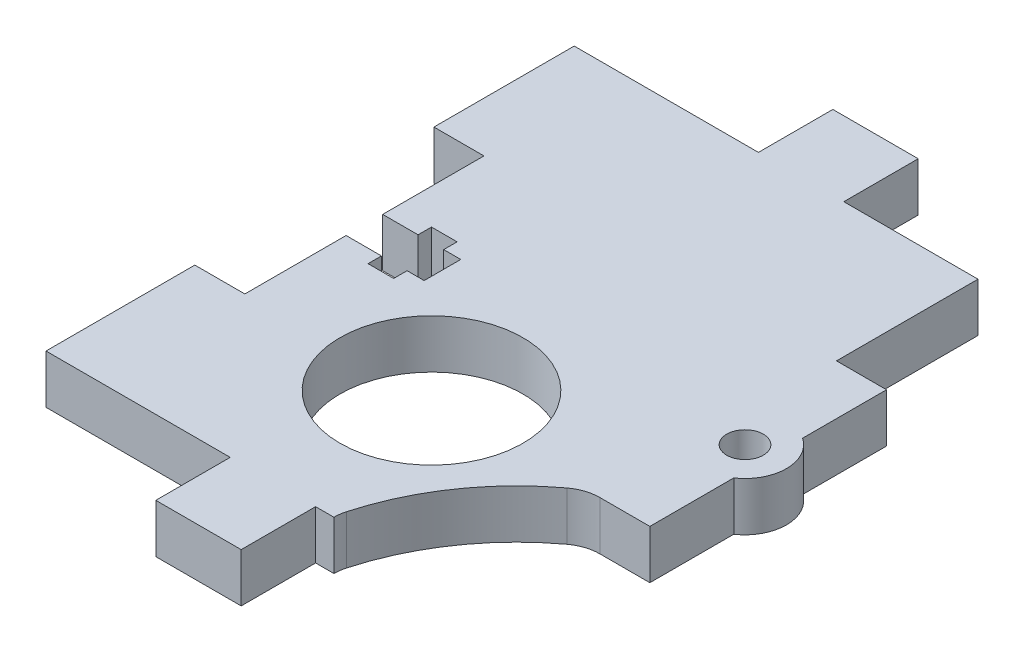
ISO-10303-21;
HEADER;
FILE_DESCRIPTION(('STEP AP214'),'2;1');
FILE_NAME('part.step','',(''),(''),'','','');
FILE_SCHEMA(('AUTOMOTIVE_DESIGN { 1 0 10303 214 1 1 1 1 }'));
ENDSEC;
DATA;
#1=APPLICATION_CONTEXT('core data for automotive mechanical design processes');
#2=APPLICATION_PROTOCOL_DEFINITION('international standard','automotive_design',2000,#1);
#3=PRODUCT_CONTEXT('',#1,'mechanical');
#4=PRODUCT('Part','Part','',(#3));
#5=PRODUCT_RELATED_PRODUCT_CATEGORY('part','',(#4));
#6=PRODUCT_DEFINITION_FORMATION('','',#4);
#7=PRODUCT_DEFINITION_CONTEXT('part definition',#1,'design');
#8=PRODUCT_DEFINITION('design','',#6,#7);
#9=PRODUCT_DEFINITION_SHAPE('','',#8);
#10=(LENGTH_UNIT() NAMED_UNIT(*) SI_UNIT(.MILLI.,.METRE.));
#11=(NAMED_UNIT(*) PLANE_ANGLE_UNIT() SI_UNIT($,.RADIAN.));
#12=(NAMED_UNIT(*) SI_UNIT($,.STERADIAN.) SOLID_ANGLE_UNIT());
#13=UNCERTAINTY_MEASURE_WITH_UNIT(LENGTH_MEASURE(1.E-05),#10,'distance_accuracy_value','');
#14=(GEOMETRIC_REPRESENTATION_CONTEXT(3) GLOBAL_UNCERTAINTY_ASSIGNED_CONTEXT((#13)) GLOBAL_UNIT_ASSIGNED_CONTEXT((#10,
#11,#12)) REPRESENTATION_CONTEXT('',''));
#15=CARTESIAN_POINT('',(0.,0.,0.));
#16=DIRECTION('',(0.,0.,1.));
#17=DIRECTION('',(1.,0.,0.));
#18=AXIS2_PLACEMENT_3D('',#15,#16,#17);
#19=CARTESIAN_POINT('',(-9.5,-2.,-2.6));
#20=DIRECTION('',(-1.,0.,0.));
#21=DIRECTION('',(0.,0.,1.));
#22=AXIS2_PLACEMENT_3D('',#19,#20,#21);
#23=PLANE('',#22);
#24=DIRECTION('',(0.,1.,0.));
#25=VECTOR('',#24,1.);
#26=CARTESIAN_POINT('',(-9.5,-2.,-2.6));
#27=LINE('',#26,#25);
#28=CARTESIAN_POINT('',(-9.5,-2.,-2.6));
#29=VERTEX_POINT('',#28);
#30=CARTESIAN_POINT('',(-9.5,2.,-2.6));
#31=VERTEX_POINT('',#30);
#32=EDGE_CURVE('E708',#29,#31,#27,.T.);
#33=ORIENTED_EDGE('',*,*,#32,.F.);
#34=DIRECTION('',(0.,0.,1.));
#35=VECTOR('',#34,1.);
#36=CARTESIAN_POINT('',(-9.5,-2.,-2.6));
#37=LINE('',#36,#35);
#38=CARTESIAN_POINT('',(-9.5,-2.,-1.5));
#39=VERTEX_POINT('',#38);
#40=EDGE_CURVE('E474',#29,#39,#37,.T.);
#41=ORIENTED_EDGE('',*,*,#40,.T.);
#42=DIRECTION('',(0.,1.,0.));
#43=VECTOR('',#42,1.);
#44=CARTESIAN_POINT('',(-9.5,-2.,-1.5));
#45=LINE('',#44,#43);
#46=CARTESIAN_POINT('',(-9.5,2.,-1.5));
#47=VERTEX_POINT('',#46);
#48=EDGE_CURVE('E464',#47,#39,#45,.F.);
#49=ORIENTED_EDGE('',*,*,#48,.F.);
#50=DIRECTION('',(0.,0.,1.));
#51=VECTOR('',#50,1.);
#52=CARTESIAN_POINT('',(-9.5,2.,0.));
#53=LINE('',#52,#51);
#54=EDGE_CURVE('E412',#31,#47,#53,.T.);
#55=ORIENTED_EDGE('',*,*,#54,.F.);
#56=EDGE_LOOP('',(#33,#41,#49,#55));
#57=FACE_BOUND('',#56,.T.);
#58=ADVANCED_FACE('F17',(#57),#23,.T.);
#59=CARTESIAN_POINT('',(-11.6,-2.,-1.5));
#60=DIRECTION('',(1.,0.,0.));
#61=DIRECTION('',(0.,0.,-1.));
#62=AXIS2_PLACEMENT_3D('',#59,#60,#61);
#63=PLANE('',#62);
#64=DIRECTION('',(0.,1.,0.));
#65=VECTOR('',#64,1.);
#66=CARTESIAN_POINT('',(-11.6,-2.,-1.5));
#67=LINE('',#66,#65);
#68=CARTESIAN_POINT('',(-11.6,-2.,-1.5));
#69=VERTEX_POINT('',#68);
#70=CARTESIAN_POINT('',(-11.6,2.,-1.5));
#71=VERTEX_POINT('',#70);
#72=EDGE_CURVE('E717',#69,#71,#67,.T.);
#73=ORIENTED_EDGE('',*,*,#72,.F.);
#74=DIRECTION('',(0.,0.,-1.));
#75=VECTOR('',#74,1.);
#76=CARTESIAN_POINT('',(-11.6,-2.,-1.5));
#77=LINE('',#76,#75);
#78=CARTESIAN_POINT('',(-11.6,-2.,-2.6));
#79=VERTEX_POINT('',#78);
#80=EDGE_CURVE('E471',#69,#79,#77,.T.);
#81=ORIENTED_EDGE('',*,*,#80,.T.);
#82=DIRECTION('',(0.,1.,0.));
#83=VECTOR('',#82,1.);
#84=CARTESIAN_POINT('',(-11.6,-2.,-2.6));
#85=LINE('',#84,#83);
#86=CARTESIAN_POINT('',(-11.6,2.,-2.6));
#87=VERTEX_POINT('',#86);
#88=EDGE_CURVE('E700',#87,#79,#85,.F.);
#89=ORIENTED_EDGE('',*,*,#88,.F.);
#90=DIRECTION('',(0.,0.,1.));
#91=VECTOR('',#90,1.);
#92=CARTESIAN_POINT('',(-11.6,2.,0.));
#93=LINE('',#92,#91);
#94=EDGE_CURVE('E415',#71,#87,#93,.F.);
#95=ORIENTED_EDGE('',*,*,#94,.F.);
#96=EDGE_LOOP('',(#73,#81,#89,#95));
#97=FACE_BOUND('',#96,.T.);
#98=ADVANCED_FACE('F757',(#97),#63,.T.);
#99=CARTESIAN_POINT('',(-8.1,-2.,1.5));
#100=DIRECTION('',(0.,0.,-1.));
#101=DIRECTION('',(-1.,0.,0.));
#102=AXIS2_PLACEMENT_3D('',#99,#100,#101);
#103=PLANE('',#102);
#104=DIRECTION('',(0.,1.,0.));
#105=VECTOR('',#104,1.);
#106=CARTESIAN_POINT('',(-8.1,-2.,1.5));
#107=LINE('',#106,#105);
#108=CARTESIAN_POINT('',(-8.1,-2.,1.5));
#109=VERTEX_POINT('',#108);
#110=CARTESIAN_POINT('',(-8.1,2.,1.5));
#111=VERTEX_POINT('',#110);
#112=EDGE_CURVE('E697',#109,#111,#107,.T.);
#113=ORIENTED_EDGE('',*,*,#112,.F.);
#114=DIRECTION('',(-1.,0.,0.));
#115=VECTOR('',#114,1.);
#116=CARTESIAN_POINT('',(-8.1,-2.,1.5));
#117=LINE('',#116,#115);
#118=CARTESIAN_POINT('',(-9.5,-2.,1.5));
#119=VERTEX_POINT('',#118);
#120=EDGE_CURVE('E468',#109,#119,#117,.T.);
#121=ORIENTED_EDGE('',*,*,#120,.T.);
#122=DIRECTION('',(0.,1.,0.));
#123=VECTOR('',#122,1.);
#124=CARTESIAN_POINT('',(-9.5,-2.,1.5));
#125=LINE('',#124,#123);
#126=CARTESIAN_POINT('',(-9.5,2.,1.5));
#127=VERTEX_POINT('',#126);
#128=EDGE_CURVE('E457',#127,#119,#125,.F.);
#129=ORIENTED_EDGE('',*,*,#128,.F.);
#130=DIRECTION('',(1.,0.,0.));
#131=VECTOR('',#130,1.);
#132=CARTESIAN_POINT('',(0.,2.,1.5));
#133=LINE('',#132,#131);
#134=EDGE_CURVE('E406',#111,#127,#133,.F.);
#135=ORIENTED_EDGE('',*,*,#134,.F.);
#136=EDGE_LOOP('',(#113,#121,#129,#135));
#137=FACE_BOUND('',#136,.T.);
#138=ADVANCED_FACE('F778',(#137),#103,.T.);
#139=CARTESIAN_POINT('',(-9.5,-2.,-1.5));
#140=DIRECTION('',(0.,0.,1.));
#141=DIRECTION('',(1.,0.,0.));
#142=AXIS2_PLACEMENT_3D('',#139,#140,#141);
#143=PLANE('',#142);
#144=ORIENTED_EDGE('',*,*,#48,.T.);
#145=DIRECTION('',(1.,0.,0.));
#146=VECTOR('',#145,1.);
#147=CARTESIAN_POINT('',(-9.5,-2.,-1.5));
#148=LINE('',#147,#146);
#149=CARTESIAN_POINT('',(-8.1,-2.,-1.5));
#150=VERTEX_POINT('',#149);
#151=EDGE_CURVE('E461',#39,#150,#148,.T.);
#152=ORIENTED_EDGE('',*,*,#151,.T.);
#153=DIRECTION('',(0.,1.,0.));
#154=VECTOR('',#153,1.);
#155=CARTESIAN_POINT('',(-8.1,-2.,-1.5));
#156=LINE('',#155,#154);
#157=CARTESIAN_POINT('',(-8.1,2.,-1.5));
#158=VERTEX_POINT('',#157);
#159=EDGE_CURVE('E689',#158,#150,#156,.F.);
#160=ORIENTED_EDGE('',*,*,#159,.F.);
#161=DIRECTION('',(1.,0.,0.));
#162=VECTOR('',#161,1.);
#163=CARTESIAN_POINT('',(0.,2.,-1.5));
#164=LINE('',#163,#162);
#165=EDGE_CURVE('E409',#47,#158,#164,.T.);
#166=ORIENTED_EDGE('',*,*,#165,.F.);
#167=EDGE_LOOP('',(#144,#152,#160,#166));
#168=FACE_BOUND('',#167,.T.);
#169=ADVANCED_FACE('F775',(#168),#143,.T.);
#170=CARTESIAN_POINT('',(-9.5,-2.,1.5));
#171=DIRECTION('',(-1.,0.,0.));
#172=DIRECTION('',(0.,0.,1.));
#173=AXIS2_PLACEMENT_3D('',#170,#171,#172);
#174=PLANE('',#173);
#175=ORIENTED_EDGE('',*,*,#128,.T.);
#176=DIRECTION('',(0.,0.,1.));
#177=VECTOR('',#176,1.);
#178=CARTESIAN_POINT('',(-9.5,-2.,1.5));
#179=LINE('',#178,#177);
#180=CARTESIAN_POINT('',(-9.5,-2.,2.6));
#181=VERTEX_POINT('',#180);
#182=EDGE_CURVE('E454',#119,#181,#179,.T.);
#183=ORIENTED_EDGE('',*,*,#182,.T.);
#184=DIRECTION('',(0.,1.,0.));
#185=VECTOR('',#184,1.);
#186=CARTESIAN_POINT('',(-9.5,-2.,2.6));
#187=LINE('',#186,#185);
#188=CARTESIAN_POINT('',(-9.5,2.,2.6));
#189=VERTEX_POINT('',#188);
#190=EDGE_CURVE('E678',#189,#181,#187,.F.);
#191=ORIENTED_EDGE('',*,*,#190,.F.);
#192=DIRECTION('',(0.,0.,1.));
#193=VECTOR('',#192,1.);
#194=CARTESIAN_POINT('',(-9.5,2.,0.));
#195=LINE('',#194,#193);
#196=EDGE_CURVE('E398',#127,#189,#195,.T.);
#197=ORIENTED_EDGE('',*,*,#196,.F.);
#198=EDGE_LOOP('',(#175,#183,#191,#197));
#199=FACE_BOUND('',#198,.T.);
#200=ADVANCED_FACE('F777',(#199),#174,.T.);
#201=CARTESIAN_POINT('',(-11.6,-2.,2.6));
#202=DIRECTION('',(1.,0.,0.));
#203=DIRECTION('',(0.,0.,-1.));
#204=AXIS2_PLACEMENT_3D('',#201,#202,#203);
#205=PLANE('',#204);
#206=DIRECTION('',(0.,1.,0.));
#207=VECTOR('',#206,1.);
#208=CARTESIAN_POINT('',(-11.6,-2.,2.6));
#209=LINE('',#208,#207);
#210=CARTESIAN_POINT('',(-11.6,-2.,2.6));
#211=VERTEX_POINT('',#210);
#212=CARTESIAN_POINT('',(-11.6,2.,2.6));
#213=VERTEX_POINT('',#212);
#214=EDGE_CURVE('E686',#211,#213,#209,.T.);
#215=ORIENTED_EDGE('',*,*,#214,.F.);
#216=DIRECTION('',(0.,0.,-1.));
#217=VECTOR('',#216,1.);
#218=CARTESIAN_POINT('',(-11.6,-2.,2.6));
#219=LINE('',#218,#217);
#220=CARTESIAN_POINT('',(-11.6,-2.,1.5));
#221=VERTEX_POINT('',#220);
#222=EDGE_CURVE('E451',#211,#221,#219,.T.);
#223=ORIENTED_EDGE('',*,*,#222,.T.);
#224=DIRECTION('',(0.,1.,0.));
#225=VECTOR('',#224,1.);
#226=CARTESIAN_POINT('',(-11.6,-2.,1.5));
#227=LINE('',#226,#225);
#228=CARTESIAN_POINT('',(-11.6,2.,1.5));
#229=VERTEX_POINT('',#228);
#230=EDGE_CURVE('E670',#229,#221,#227,.F.);
#231=ORIENTED_EDGE('',*,*,#230,.F.);
#232=DIRECTION('',(0.,0.,1.));
#233=VECTOR('',#232,1.);
#234=CARTESIAN_POINT('',(-11.6,2.,0.));
#235=LINE('',#234,#233);
#236=EDGE_CURVE('E392',#213,#229,#235,.F.);
#237=ORIENTED_EDGE('',*,*,#236,.F.);
#238=EDGE_LOOP('',(#215,#223,#231,#237));
#239=FACE_BOUND('',#238,.T.);
#240=ADVANCED_FACE('F785',(#239),#205,.T.);
#241=CARTESIAN_POINT('',(3.5,-2.,22.));
#242=DIRECTION('',(0.,0.,1.));
#243=DIRECTION('',(1.,0.,0.));
#244=AXIS2_PLACEMENT_3D('',#241,#242,#243);
#245=PLANE('',#244);
#246=DIRECTION('',(0.,1.,0.));
#247=VECTOR('',#246,1.);
#248=CARTESIAN_POINT('',(3.5,-2.,22.));
#249=LINE('',#248,#247);
#250=CARTESIAN_POINT('',(3.5,-2.,22.));
#251=VERTEX_POINT('',#250);
#252=CARTESIAN_POINT('',(3.5,2.,22.));
#253=VERTEX_POINT('',#252);
#254=EDGE_CURVE('E478',#251,#253,#249,.T.);
#255=ORIENTED_EDGE('',*,*,#254,.F.);
#256=DIRECTION('',(1.,0.,0.));
#257=VECTOR('',#256,1.);
#258=CARTESIAN_POINT('',(3.5,-2.,22.));
#259=LINE('',#258,#257);
#260=CARTESIAN_POINT('',(5.,-2.,22.));
#261=VERTEX_POINT('',#260);
#262=EDGE_CURVE('E330',#251,#261,#259,.T.);
#263=ORIENTED_EDGE('',*,*,#262,.T.);
#264=DIRECTION('',(0.,1.,0.));
#265=VECTOR('',#264,1.);
#266=CARTESIAN_POINT('',(5.,-2.,22.));
#267=LINE('',#266,#265);
#268=CARTESIAN_POINT('',(5.,2.,22.));
#269=VERTEX_POINT('',#268);
#270=EDGE_CURVE('E326',#261,#269,#267,.T.);
#271=ORIENTED_EDGE('',*,*,#270,.T.);
#272=DIRECTION('',(1.,0.,0.));
#273=VECTOR('',#272,1.);
#274=CARTESIAN_POINT('',(0.,2.,22.));
#275=LINE('',#274,#273);
#276=EDGE_CURVE('E385',#253,#269,#275,.T.);
#277=ORIENTED_EDGE('',*,*,#276,.F.);
#278=EDGE_LOOP('',(#255,#263,#271,#277));
#279=FACE_BOUND('',#278,.T.);
#280=ADVANCED_FACE('F906',(#279),#245,.T.);
#281=CARTESIAN_POINT('',(8.4,-2.,22.));
#282=DIRECTION('',(0.,1.,0.));
#283=DIRECTION('',(0.,0.,1.));
#284=AXIS2_PLACEMENT_3D('',#281,#282,#283);
#285=CYLINDRICAL_SURFACE('',#284,3.4);
#286=CARTESIAN_POINT('',(8.4,2.,22.));
#287=DIRECTION('',(0.,1.,0.));
#288=DIRECTION('',(0.,0.,1.));
#289=AXIS2_PLACEMENT_3D('',#286,#287,#288);
#290=CIRCLE('',#289,3.4);
#291=CARTESIAN_POINT('',(5.12304267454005,2.,21.093605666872));
#292=VERTEX_POINT('',#291);
#293=EDGE_CURVE('E382',#269,#292,#290,.F.);
#294=ORIENTED_EDGE('',*,*,#293,.F.);
#295=ORIENTED_EDGE('',*,*,#270,.F.);
#296=CARTESIAN_POINT('',(8.4,-2.,22.));
#297=DIRECTION('',(0.,1.,0.));
#298=DIRECTION('',(0.,0.,1.));
#299=AXIS2_PLACEMENT_3D('',#296,#297,#298);
#300=CIRCLE('',#299,3.4);
#301=CARTESIAN_POINT('',(5.12304267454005,-2.,21.093605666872));
#302=VERTEX_POINT('',#301);
#303=EDGE_CURVE('E20',#302,#261,#300,.T.);
#304=ORIENTED_EDGE('',*,*,#303,.F.);
#305=DIRECTION('',(0.,1.,0.));
#306=VECTOR('',#305,1.);
#307=CARTESIAN_POINT('',(5.12304267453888,-2.,21.0936056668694));
#308=LINE('',#307,#306);
#309=EDGE_CURVE('E324',#302,#292,#308,.T.);
#310=ORIENTED_EDGE('',*,*,#309,.T.);
#311=EDGE_LOOP('',(#294,#295,#304,#310));
#312=FACE_BOUND('',#311,.T.);
#313=ADVANCED_FACE('F323',(#312),#285,.F.);
#314=CARTESIAN_POINT('',(0.,2.,0.));
#315=DIRECTION('',(0.,1.,0.));
#316=DIRECTION('',(0.,0.,1.));
#317=AXIS2_PLACEMENT_3D('',#314,#315,#316);
#318=PLANE('',#317);
#319=CARTESIAN_POINT('',(0.,2.,9.));
#320=DIRECTION('',(0.,1.,0.));
#321=DIRECTION('',(0.,0.,1.));
#322=AXIS2_PLACEMENT_3D('',#319,#320,#321);
#323=CIRCLE('',#322,7.5);
#324=CARTESIAN_POINT('',(0.,2.,16.5));
#325=VERTEX_POINT('',#324);
#326=EDGE_CURVE('E361',#325,#325,#323,.F.);
#327=ORIENTED_EDGE('',*,*,#326,.T.);
#328=EDGE_LOOP('',(#327));
#329=FACE_BOUND('',#328,.T.);
#330=CARTESIAN_POINT('',(16.7,2.,0.));
#331=DIRECTION('',(0.,1.,0.));
#332=DIRECTION('',(0.,0.,1.));
#333=AXIS2_PLACEMENT_3D('',#330,#331,#332);
#334=CIRCLE('',#333,1.5);
#335=CARTESIAN_POINT('',(16.7,2.,1.5));
#336=VERTEX_POINT('',#335);
#337=EDGE_CURVE('E366',#336,#336,#334,.F.);
#338=ORIENTED_EDGE('',*,*,#337,.T.);
#339=EDGE_LOOP('',(#338));
#340=FACE_BOUND('',#339,.T.);
#341=DIRECTION('',(-1.,0.,0.));
#342=VECTOR('',#341,1.);
#343=CARTESIAN_POINT('',(-3.5,2.,-21.3));
#344=LINE('',#343,#342);
#345=CARTESIAN_POINT('',(-18.6,2.,-21.3));
#346=VERTEX_POINT('',#345);
#347=CARTESIAN_POINT('',(-3.5,2.,-21.3));
#348=VERTEX_POINT('',#347);
#349=EDGE_CURVE('E582',#346,#348,#344,.F.);
#350=ORIENTED_EDGE('',*,*,#349,.F.);
#351=DIRECTION('',(0.,0.,1.));
#352=VECTOR('',#351,1.);
#353=CARTESIAN_POINT('',(-18.6,2.,-21.3));
#354=LINE('',#353,#352);
#355=CARTESIAN_POINT('',(-18.6,2.,-9.8));
#356=VERTEX_POINT('',#355);
#357=EDGE_CURVE('E384',#356,#346,#354,.F.);
#358=ORIENTED_EDGE('',*,*,#357,.F.);
#359=DIRECTION('',(1.,0.,0.));
#360=VECTOR('',#359,1.);
#361=CARTESIAN_POINT('',(-18.6,2.,-9.8));
#362=LINE('',#361,#360);
#363=CARTESIAN_POINT('',(-14.5,2.,-9.8));
#364=VERTEX_POINT('',#363);
#365=EDGE_CURVE('E389',#364,#356,#362,.F.);
#366=ORIENTED_EDGE('',*,*,#365,.F.);
#367=DIRECTION('',(0.,0.,1.));
#368=VECTOR('',#367,1.);
#369=CARTESIAN_POINT('',(-14.5,2.,-9.8));
#370=LINE('',#369,#368);
#371=CARTESIAN_POINT('',(-14.5,2.,-1.5));
#372=VERTEX_POINT('',#371);
#373=EDGE_CURVE('E723',#372,#364,#370,.F.);
#374=ORIENTED_EDGE('',*,*,#373,.F.);
#375=DIRECTION('',(1.,0.,0.));
#376=VECTOR('',#375,1.);
#377=CARTESIAN_POINT('',(-14.5,2.,-1.5));
#378=LINE('',#377,#376);
#379=EDGE_CURVE('E714',#71,#372,#378,.F.);
#380=ORIENTED_EDGE('',*,*,#379,.F.);
#381=ORIENTED_EDGE('',*,*,#94,.T.);
#382=DIRECTION('',(1.,0.,0.));
#383=VECTOR('',#382,1.);
#384=CARTESIAN_POINT('',(-11.6,2.,-2.6));
#385=LINE('',#384,#383);
#386=EDGE_CURVE('E704',#31,#87,#385,.F.);
#387=ORIENTED_EDGE('',*,*,#386,.F.);
#388=ORIENTED_EDGE('',*,*,#54,.T.);
#389=ORIENTED_EDGE('',*,*,#165,.T.);
#390=DIRECTION('',(0.,0.,1.));
#391=VECTOR('',#390,1.);
#392=CARTESIAN_POINT('',(-8.1,2.,-1.5));
#393=LINE('',#392,#391);
#394=EDGE_CURVE('E693',#111,#158,#393,.F.);
#395=ORIENTED_EDGE('',*,*,#394,.F.);
#396=ORIENTED_EDGE('',*,*,#134,.T.);
#397=ORIENTED_EDGE('',*,*,#196,.T.);
#398=DIRECTION('',(-1.,0.,0.));
#399=VECTOR('',#398,1.);
#400=CARTESIAN_POINT('',(-9.5,2.,2.6));
#401=LINE('',#400,#399);
#402=EDGE_CURVE('E682',#213,#189,#401,.F.);
#403=ORIENTED_EDGE('',*,*,#402,.F.);
#404=ORIENTED_EDGE('',*,*,#236,.T.);
#405=DIRECTION('',(-1.,0.,0.));
#406=VECTOR('',#405,1.);
#407=CARTESIAN_POINT('',(-11.6,2.,1.5));
#408=LINE('',#407,#406);
#409=CARTESIAN_POINT('',(-14.5,2.,1.5));
#410=VERTEX_POINT('',#409);
#411=EDGE_CURVE('E674',#410,#229,#408,.F.);
#412=ORIENTED_EDGE('',*,*,#411,.F.);
#413=DIRECTION('',(0.,0.,1.));
#414=VECTOR('',#413,1.);
#415=CARTESIAN_POINT('',(-14.5,2.,1.5));
#416=LINE('',#415,#414);
#417=CARTESIAN_POINT('',(-14.5,2.,9.8));
#418=VERTEX_POINT('',#417);
#419=EDGE_CURVE('E667',#418,#410,#416,.F.);
#420=ORIENTED_EDGE('',*,*,#419,.F.);
#421=DIRECTION('',(-1.,0.,0.));
#422=VECTOR('',#421,1.);
#423=CARTESIAN_POINT('',(-14.5,2.,9.8));
#424=LINE('',#423,#422);
#425=CARTESIAN_POINT('',(-18.6,2.,9.8));
#426=VERTEX_POINT('',#425);
#427=EDGE_CURVE('E661',#426,#418,#424,.F.);
#428=ORIENTED_EDGE('',*,*,#427,.F.);
#429=DIRECTION('',(0.,0.,1.));
#430=VECTOR('',#429,1.);
#431=CARTESIAN_POINT('',(-18.6,2.,9.8));
#432=LINE('',#431,#430);
#433=CARTESIAN_POINT('',(-18.6,2.,22.));
#434=VERTEX_POINT('',#433);
#435=EDGE_CURVE('E655',#434,#426,#432,.F.);
#436=ORIENTED_EDGE('',*,*,#435,.F.);
#437=DIRECTION('',(1.,0.,0.));
#438=VECTOR('',#437,1.);
#439=CARTESIAN_POINT('',(-18.6,2.,22.));
#440=LINE('',#439,#438);
#441=CARTESIAN_POINT('',(-3.5,2.,22.));
#442=VERTEX_POINT('',#441);
#443=EDGE_CURVE('E649',#442,#434,#440,.F.);
#444=ORIENTED_EDGE('',*,*,#443,.F.);
#445=DIRECTION('',(0.,0.,1.));
#446=VECTOR('',#445,1.);
#447=CARTESIAN_POINT('',(-3.5,2.,22.));
#448=LINE('',#447,#446);
#449=CARTESIAN_POINT('',(-3.5,2.,28.1));
#450=VERTEX_POINT('',#449);
#451=EDGE_CURVE('E643',#450,#442,#448,.F.);
#452=ORIENTED_EDGE('',*,*,#451,.F.);
#453=DIRECTION('',(1.,0.,0.));
#454=VECTOR('',#453,1.);
#455=CARTESIAN_POINT('',(-3.5,2.,28.1));
#456=LINE('',#455,#454);
#457=CARTESIAN_POINT('',(3.5,2.,28.1));
#458=VERTEX_POINT('',#457);
#459=EDGE_CURVE('E637',#458,#450,#456,.F.);
#460=ORIENTED_EDGE('',*,*,#459,.F.);
#461=DIRECTION('',(0.,0.,-1.));
#462=VECTOR('',#461,1.);
#463=CARTESIAN_POINT('',(3.5,2.,28.1));
#464=LINE('',#463,#462);
#465=EDGE_CURVE('E480',#253,#458,#464,.F.);
#466=ORIENTED_EDGE('',*,*,#465,.F.);
#467=ORIENTED_EDGE('',*,*,#276,.T.);
#468=ORIENTED_EDGE('',*,*,#293,.T.);
#469=CARTESIAN_POINT('',(24.39926223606,2.,26.4253370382));
#470=DIRECTION('',(0.,1.,0.));
#471=DIRECTION('',(0.,0.,1.));
#472=AXIS2_PLACEMENT_3D('',#469,#470,#471);
#473=CIRCLE('',#472,20.);
#474=CARTESIAN_POINT('',(12.472440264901,2.,10.3707141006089));
#475=VERTEX_POINT('',#474);
#476=EDGE_CURVE('E337',#292,#475,#473,.F.);
#477=ORIENTED_EDGE('',*,*,#476,.T.);
#478=CARTESIAN_POINT('',(14.5,2.,13.1));
#479=DIRECTION('',(0.,1.,0.));
#480=DIRECTION('',(0.,0.,1.));
#481=AXIS2_PLACEMENT_3D('',#478,#479,#480);
#482=CIRCLE('',#481,3.4);
#483=CARTESIAN_POINT('',(14.5,2.,9.7));
#484=VERTEX_POINT('',#483);
#485=EDGE_CURVE('E375',#475,#484,#482,.F.);
#486=ORIENTED_EDGE('',*,*,#485,.T.);
#487=DIRECTION('',(1.,0.,0.));
#488=VECTOR('',#487,1.);
#489=CARTESIAN_POINT('',(14.5,2.,9.7));
#490=LINE('',#489,#488);
#491=CARTESIAN_POINT('',(18.6,2.,9.7));
#492=VERTEX_POINT('',#491);
#493=EDGE_CURVE('E379',#492,#484,#490,.F.);
#494=ORIENTED_EDGE('',*,*,#493,.F.);
#495=DIRECTION('',(0.,0.,-1.));
#496=VECTOR('',#495,1.);
#497=CARTESIAN_POINT('',(18.6,2.,9.7));
#498=LINE('',#497,#496);
#499=CARTESIAN_POINT('',(18.6000000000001,2.,2.81957443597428));
#500=VERTEX_POINT('',#499);
#501=EDGE_CURVE('E441',#500,#492,#498,.F.);
#502=ORIENTED_EDGE('',*,*,#501,.F.);
#503=CARTESIAN_POINT('',(16.7,2.,0.));
#504=DIRECTION('',(0.,1.,0.));
#505=DIRECTION('',(0.,0.,1.));
#506=AXIS2_PLACEMENT_3D('',#503,#504,#505);
#507=CIRCLE('',#506,3.4);
#508=CARTESIAN_POINT('',(18.6,2.,-2.81957443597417));
#509=VERTEX_POINT('',#508);
#510=EDGE_CURVE('E370',#509,#500,#507,.F.);
#511=ORIENTED_EDGE('',*,*,#510,.F.);
#512=DIRECTION('',(0.,0.,-1.));
#513=VECTOR('',#512,1.);
#514=CARTESIAN_POINT('',(18.6,2.,-2.819574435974));
#515=LINE('',#514,#513);
#516=CARTESIAN_POINT('',(18.6,2.,-9.7));
#517=VERTEX_POINT('',#516);
#518=EDGE_CURVE('E418',#517,#509,#515,.F.);
#519=ORIENTED_EDGE('',*,*,#518,.F.);
#520=DIRECTION('',(-1.,0.,0.));
#521=VECTOR('',#520,1.);
#522=CARTESIAN_POINT('',(18.6,2.,-9.7));
#523=LINE('',#522,#521);
#524=CARTESIAN_POINT('',(14.5,2.,-9.7));
#525=VERTEX_POINT('',#524);
#526=EDGE_CURVE('E424',#525,#517,#523,.F.);
#527=ORIENTED_EDGE('',*,*,#526,.F.);
#528=DIRECTION('',(0.,0.,-1.));
#529=VECTOR('',#528,1.);
#530=CARTESIAN_POINT('',(14.5,2.,-9.7));
#531=LINE('',#530,#529);
#532=CARTESIAN_POINT('',(14.5,2.,-21.3));
#533=VERTEX_POINT('',#532);
#534=EDGE_CURVE('E430',#533,#525,#531,.F.);
#535=ORIENTED_EDGE('',*,*,#534,.F.);
#536=DIRECTION('',(-1.,0.,0.));
#537=VECTOR('',#536,1.);
#538=CARTESIAN_POINT('',(14.5,2.,-21.3));
#539=LINE('',#538,#537);
#540=CARTESIAN_POINT('',(3.5,2.,-21.3));
#541=VERTEX_POINT('',#540);
#542=EDGE_CURVE('E438',#541,#533,#539,.F.);
#543=ORIENTED_EDGE('',*,*,#542,.F.);
#544=DIRECTION('',(0.,0.,-1.));
#545=VECTOR('',#544,1.);
#546=CARTESIAN_POINT('',(3.5,2.,-21.3));
#547=LINE('',#546,#545);
#548=CARTESIAN_POINT('',(3.5,2.,-27.4));
#549=VERTEX_POINT('',#548);
#550=EDGE_CURVE('E603',#549,#541,#547,.F.);
#551=ORIENTED_EDGE('',*,*,#550,.F.);
#552=DIRECTION('',(-1.,0.,0.));
#553=VECTOR('',#552,1.);
#554=CARTESIAN_POINT('',(3.5,2.,-27.4));
#555=LINE('',#554,#553);
#556=CARTESIAN_POINT('',(-3.5,2.,-27.4));
#557=VERTEX_POINT('',#556);
#558=EDGE_CURVE('E598',#557,#549,#555,.F.);
#559=ORIENTED_EDGE('',*,*,#558,.F.);
#560=DIRECTION('',(0.,0.,1.));
#561=VECTOR('',#560,1.);
#562=CARTESIAN_POINT('',(-3.5,2.,-27.4));
#563=LINE('',#562,#561);
#564=EDGE_CURVE('E592',#348,#557,#563,.F.);
#565=ORIENTED_EDGE('',*,*,#564,.F.);
#566=EDGE_LOOP('',(#350,#358,#366,#374,#380,#381,#387,#388,#389,#395,#396,#397,#403,#404,#412,
#420,#428,#436,#444,#452,#460,#466,#467,#468,#477,#486,#494,#502,#511,#519,#527,#535,#543,#551,
#559,#565));
#567=FACE_BOUND('',#566,.T.);
#568=ADVANCED_FACE('F738',(#329,#340,#567),#318,.T.);
#569=CARTESIAN_POINT('',(-18.6,-2.,-21.3));
#570=DIRECTION('',(-1.,0.,0.));
#571=DIRECTION('',(0.,0.,1.));
#572=AXIS2_PLACEMENT_3D('',#569,#570,#571);
#573=PLANE('',#572);
#574=DIRECTION('',(0.,1.,0.));
#575=VECTOR('',#574,1.);
#576=CARTESIAN_POINT('',(-18.6,-2.,-21.3));
#577=LINE('',#576,#575);
#578=CARTESIAN_POINT('',(-18.6,-2.,-21.3));
#579=VERTEX_POINT('',#578);
#580=EDGE_CURVE('E585',#579,#346,#577,.T.);
#581=ORIENTED_EDGE('',*,*,#580,.F.);
#582=DIRECTION('',(0.,0.,1.));
#583=VECTOR('',#582,1.);
#584=CARTESIAN_POINT('',(-18.6,-2.,0.));
#585=LINE('',#584,#583);
#586=CARTESIAN_POINT('',(-18.6,-2.,-9.8));
#587=VERTEX_POINT('',#586);
#588=EDGE_CURVE('E365',#579,#587,#585,.T.);
#589=ORIENTED_EDGE('',*,*,#588,.T.);
#590=DIRECTION('',(0.,1.,0.));
#591=VECTOR('',#590,1.);
#592=CARTESIAN_POINT('',(-18.6,-2.,-9.8));
#593=LINE('',#592,#591);
#594=EDGE_CURVE('E726',#356,#587,#593,.F.);
#595=ORIENTED_EDGE('',*,*,#594,.F.);
#596=ORIENTED_EDGE('',*,*,#357,.T.);
#597=EDGE_LOOP('',(#581,#589,#595,#596));
#598=FACE_BOUND('',#597,.T.);
#599=ADVANCED_FACE('F742',(#598),#573,.T.);
#600=CARTESIAN_POINT('',(-18.6,-2.,-9.8));
#601=DIRECTION('',(0.,0.,1.));
#602=DIRECTION('',(1.,0.,0.));
#603=AXIS2_PLACEMENT_3D('',#600,#601,#602);
#604=PLANE('',#603);
#605=ORIENTED_EDGE('',*,*,#594,.T.);
#606=DIRECTION('',(1.,0.,0.));
#607=VECTOR('',#606,1.);
#608=CARTESIAN_POINT('',(0.,-2.,-9.8));
#609=LINE('',#608,#607);
#610=CARTESIAN_POINT('',(-14.5,-2.,-9.8));
#611=VERTEX_POINT('',#610);
#612=EDGE_CURVE('E574',#587,#611,#609,.T.);
#613=ORIENTED_EDGE('',*,*,#612,.T.);
#614=DIRECTION('',(0.,1.,0.));
#615=VECTOR('',#614,1.);
#616=CARTESIAN_POINT('',(-14.5,-2.,-9.8));
#617=LINE('',#616,#615);
#618=EDGE_CURVE('E720',#364,#611,#617,.F.);
#619=ORIENTED_EDGE('',*,*,#618,.F.);
#620=ORIENTED_EDGE('',*,*,#365,.T.);
#621=EDGE_LOOP('',(#605,#613,#619,#620));
#622=FACE_BOUND('',#621,.T.);
#623=ADVANCED_FACE('F733',(#622),#604,.T.);
#624=CARTESIAN_POINT('',(-14.5,-2.,-9.8));
#625=DIRECTION('',(-1.,0.,0.));
#626=DIRECTION('',(0.,0.,1.));
#627=AXIS2_PLACEMENT_3D('',#624,#625,#626);
#628=PLANE('',#627);
#629=ORIENTED_EDGE('',*,*,#618,.T.);
#630=DIRECTION('',(0.,0.,1.));
#631=VECTOR('',#630,1.);
#632=CARTESIAN_POINT('',(-14.5,-2.,0.));
#633=LINE('',#632,#631);
#634=CARTESIAN_POINT('',(-14.5,-2.,-1.5));
#635=VERTEX_POINT('',#634);
#636=EDGE_CURVE('E570',#611,#635,#633,.T.);
#637=ORIENTED_EDGE('',*,*,#636,.T.);
#638=DIRECTION('',(0.,1.,0.));
#639=VECTOR('',#638,1.);
#640=CARTESIAN_POINT('',(-14.5,-2.,-1.5));
#641=LINE('',#640,#639);
#642=EDGE_CURVE('E711',#372,#635,#641,.F.);
#643=ORIENTED_EDGE('',*,*,#642,.F.);
#644=ORIENTED_EDGE('',*,*,#373,.T.);
#645=EDGE_LOOP('',(#629,#637,#643,#644));
#646=FACE_BOUND('',#645,.T.);
#647=ADVANCED_FACE('F748',(#646),#628,.T.);
#648=CARTESIAN_POINT('',(-14.5,-2.,-1.5));
#649=DIRECTION('',(0.,0.,1.));
#650=DIRECTION('',(1.,0.,0.));
#651=AXIS2_PLACEMENT_3D('',#648,#649,#650);
#652=PLANE('',#651);
#653=ORIENTED_EDGE('',*,*,#642,.T.);
#654=DIRECTION('',(1.,0.,0.));
#655=VECTOR('',#654,1.);
#656=CARTESIAN_POINT('',(0.,-2.,-1.5));
#657=LINE('',#656,#655);
#658=EDGE_CURVE('E566',#635,#69,#657,.T.);
#659=ORIENTED_EDGE('',*,*,#658,.T.);
#660=ORIENTED_EDGE('',*,*,#72,.T.);
#661=ORIENTED_EDGE('',*,*,#379,.T.);
#662=EDGE_LOOP('',(#653,#659,#660,#661));
#663=FACE_BOUND('',#662,.T.);
#664=ADVANCED_FACE('F753',(#663),#652,.T.);
#665=CARTESIAN_POINT('',(-11.6,-2.,-2.6));
#666=DIRECTION('',(0.,0.,1.));
#667=DIRECTION('',(1.,0.,0.));
#668=AXIS2_PLACEMENT_3D('',#665,#666,#667);
#669=PLANE('',#668);
#670=ORIENTED_EDGE('',*,*,#88,.T.);
#671=DIRECTION('',(1.,0.,0.));
#672=VECTOR('',#671,1.);
#673=CARTESIAN_POINT('',(0.,-2.,-2.6));
#674=LINE('',#673,#672);
#675=EDGE_CURVE('E562',#79,#29,#674,.T.);
#676=ORIENTED_EDGE('',*,*,#675,.T.);
#677=ORIENTED_EDGE('',*,*,#32,.T.);
#678=ORIENTED_EDGE('',*,*,#386,.T.);
#679=EDGE_LOOP('',(#670,#676,#677,#678));
#680=FACE_BOUND('',#679,.T.);
#681=ADVANCED_FACE('F760',(#680),#669,.T.);
#682=CARTESIAN_POINT('',(-8.1,-2.,-1.5));
#683=DIRECTION('',(-1.,0.,0.));
#684=DIRECTION('',(0.,0.,1.));
#685=AXIS2_PLACEMENT_3D('',#682,#683,#684);
#686=PLANE('',#685);
#687=ORIENTED_EDGE('',*,*,#159,.T.);
#688=DIRECTION('',(0.,0.,1.));
#689=VECTOR('',#688,1.);
#690=CARTESIAN_POINT('',(-8.1,-2.,0.));
#691=LINE('',#690,#689);
#692=EDGE_CURVE('E558',#150,#109,#691,.T.);
#693=ORIENTED_EDGE('',*,*,#692,.T.);
#694=ORIENTED_EDGE('',*,*,#112,.T.);
#695=ORIENTED_EDGE('',*,*,#394,.T.);
#696=EDGE_LOOP('',(#687,#693,#694,#695));
#697=FACE_BOUND('',#696,.T.);
#698=ADVANCED_FACE('F772',(#697),#686,.T.);
#699=CARTESIAN_POINT('',(-9.5,-2.,2.6));
#700=DIRECTION('',(0.,0.,-1.));
#701=DIRECTION('',(-1.,0.,0.));
#702=AXIS2_PLACEMENT_3D('',#699,#700,#701);
#703=PLANE('',#702);
#704=ORIENTED_EDGE('',*,*,#190,.T.);
#705=DIRECTION('',(1.,0.,0.));
#706=VECTOR('',#705,1.);
#707=CARTESIAN_POINT('',(0.,-2.,2.6));
#708=LINE('',#707,#706);
#709=EDGE_CURVE('E554',#181,#211,#708,.F.);
#710=ORIENTED_EDGE('',*,*,#709,.T.);
#711=ORIENTED_EDGE('',*,*,#214,.T.);
#712=ORIENTED_EDGE('',*,*,#402,.T.);
#713=EDGE_LOOP('',(#704,#710,#711,#712));
#714=FACE_BOUND('',#713,.T.);
#715=ADVANCED_FACE('F884',(#714),#703,.T.);
#716=CARTESIAN_POINT('',(-11.6,-2.,1.5));
#717=DIRECTION('',(0.,0.,-1.));
#718=DIRECTION('',(-1.,0.,0.));
#719=AXIS2_PLACEMENT_3D('',#716,#717,#718);
#720=PLANE('',#719);
#721=ORIENTED_EDGE('',*,*,#230,.T.);
#722=DIRECTION('',(1.,0.,0.));
#723=VECTOR('',#722,1.);
#724=CARTESIAN_POINT('',(0.,-2.,1.5));
#725=LINE('',#724,#723);
#726=CARTESIAN_POINT('',(-14.5,-2.,1.5));
#727=VERTEX_POINT('',#726);
#728=EDGE_CURVE('E550',#221,#727,#725,.F.);
#729=ORIENTED_EDGE('',*,*,#728,.T.);
#730=DIRECTION('',(0.,1.,0.));
#731=VECTOR('',#730,1.);
#732=CARTESIAN_POINT('',(-14.5,-2.,1.5));
#733=LINE('',#732,#731);
#734=EDGE_CURVE('E664',#410,#727,#733,.F.);
#735=ORIENTED_EDGE('',*,*,#734,.F.);
#736=ORIENTED_EDGE('',*,*,#411,.T.);
#737=EDGE_LOOP('',(#721,#729,#735,#736));
#738=FACE_BOUND('',#737,.T.);
#739=ADVANCED_FACE('F880',(#738),#720,.T.);
#740=CARTESIAN_POINT('',(-14.5,-2.,1.5));
#741=DIRECTION('',(-1.,0.,0.));
#742=DIRECTION('',(0.,0.,1.));
#743=AXIS2_PLACEMENT_3D('',#740,#741,#742);
#744=PLANE('',#743);
#745=ORIENTED_EDGE('',*,*,#734,.T.);
#746=DIRECTION('',(0.,0.,1.));
#747=VECTOR('',#746,1.);
#748=CARTESIAN_POINT('',(-14.5,-2.,0.));
#749=LINE('',#748,#747);
#750=CARTESIAN_POINT('',(-14.5,-2.,9.8));
#751=VERTEX_POINT('',#750);
#752=EDGE_CURVE('E546',#727,#751,#749,.T.);
#753=ORIENTED_EDGE('',*,*,#752,.T.);
#754=DIRECTION('',(0.,1.,0.));
#755=VECTOR('',#754,1.);
#756=CARTESIAN_POINT('',(-14.5,-2.,9.8));
#757=LINE('',#756,#755);
#758=EDGE_CURVE('E658',#418,#751,#757,.F.);
#759=ORIENTED_EDGE('',*,*,#758,.F.);
#760=ORIENTED_EDGE('',*,*,#419,.T.);
#761=EDGE_LOOP('',(#745,#753,#759,#760));
#762=FACE_BOUND('',#761,.T.);
#763=ADVANCED_FACE('F876',(#762),#744,.T.);
#764=CARTESIAN_POINT('',(-14.5,-2.,9.8));
#765=DIRECTION('',(0.,0.,-1.));
#766=DIRECTION('',(-1.,0.,0.));
#767=AXIS2_PLACEMENT_3D('',#764,#765,#766);
#768=PLANE('',#767);
#769=ORIENTED_EDGE('',*,*,#758,.T.);
#770=DIRECTION('',(1.,0.,0.));
#771=VECTOR('',#770,1.);
#772=CARTESIAN_POINT('',(0.,-2.,9.8));
#773=LINE('',#772,#771);
#774=CARTESIAN_POINT('',(-18.6,-2.,9.8));
#775=VERTEX_POINT('',#774);
#776=EDGE_CURVE('E542',#751,#775,#773,.F.);
#777=ORIENTED_EDGE('',*,*,#776,.T.);
#778=DIRECTION('',(0.,1.,0.));
#779=VECTOR('',#778,1.);
#780=CARTESIAN_POINT('',(-18.6,-2.,9.8));
#781=LINE('',#780,#779);
#782=EDGE_CURVE('E652',#426,#775,#781,.F.);
#783=ORIENTED_EDGE('',*,*,#782,.F.);
#784=ORIENTED_EDGE('',*,*,#427,.T.);
#785=EDGE_LOOP('',(#769,#777,#783,#784));
#786=FACE_BOUND('',#785,.T.);
#787=ADVANCED_FACE('F872',(#786),#768,.T.);
#788=CARTESIAN_POINT('',(-18.6,-2.,9.8));
#789=DIRECTION('',(-1.,0.,0.));
#790=DIRECTION('',(0.,0.,1.));
#791=AXIS2_PLACEMENT_3D('',#788,#789,#790);
#792=PLANE('',#791);
#793=ORIENTED_EDGE('',*,*,#782,.T.);
#794=DIRECTION('',(0.,0.,1.));
#795=VECTOR('',#794,1.);
#796=CARTESIAN_POINT('',(-18.6,-2.,0.));
#797=LINE('',#796,#795);
#798=CARTESIAN_POINT('',(-18.6,-2.,22.));
#799=VERTEX_POINT('',#798);
#800=EDGE_CURVE('E538',#775,#799,#797,.T.);
#801=ORIENTED_EDGE('',*,*,#800,.T.);
#802=DIRECTION('',(0.,1.,0.));
#803=VECTOR('',#802,1.);
#804=CARTESIAN_POINT('',(-18.6,-2.,22.));
#805=LINE('',#804,#803);
#806=EDGE_CURVE('E646',#434,#799,#805,.F.);
#807=ORIENTED_EDGE('',*,*,#806,.F.);
#808=ORIENTED_EDGE('',*,*,#435,.T.);
#809=EDGE_LOOP('',(#793,#801,#807,#808));
#810=FACE_BOUND('',#809,.T.);
#811=ADVANCED_FACE('F868',(#810),#792,.T.);
#812=CARTESIAN_POINT('',(-18.6,-2.,22.));
#813=DIRECTION('',(0.,0.,1.));
#814=DIRECTION('',(1.,0.,0.));
#815=AXIS2_PLACEMENT_3D('',#812,#813,#814);
#816=PLANE('',#815);
#817=ORIENTED_EDGE('',*,*,#806,.T.);
#818=DIRECTION('',(1.,0.,0.));
#819=VECTOR('',#818,1.);
#820=CARTESIAN_POINT('',(0.,-2.,22.));
#821=LINE('',#820,#819);
#822=CARTESIAN_POINT('',(-3.5,-2.,22.));
#823=VERTEX_POINT('',#822);
#824=EDGE_CURVE('E534',#799,#823,#821,.T.);
#825=ORIENTED_EDGE('',*,*,#824,.T.);
#826=DIRECTION('',(0.,1.,0.));
#827=VECTOR('',#826,1.);
#828=CARTESIAN_POINT('',(-3.5,-2.,22.));
#829=LINE('',#828,#827);
#830=EDGE_CURVE('E640',#442,#823,#829,.F.);
#831=ORIENTED_EDGE('',*,*,#830,.F.);
#832=ORIENTED_EDGE('',*,*,#443,.T.);
#833=EDGE_LOOP('',(#817,#825,#831,#832));
#834=FACE_BOUND('',#833,.T.);
#835=ADVANCED_FACE('F864',(#834),#816,.T.);
#836=CARTESIAN_POINT('',(-3.5,-2.,22.));
#837=DIRECTION('',(-1.,0.,0.));
#838=DIRECTION('',(0.,0.,1.));
#839=AXIS2_PLACEMENT_3D('',#836,#837,#838);
#840=PLANE('',#839);
#841=ORIENTED_EDGE('',*,*,#830,.T.);
#842=DIRECTION('',(0.,0.,1.));
#843=VECTOR('',#842,1.);
#844=CARTESIAN_POINT('',(-3.5,-2.,0.));
#845=LINE('',#844,#843);
#846=CARTESIAN_POINT('',(-3.5,-2.,28.1));
#847=VERTEX_POINT('',#846);
#848=EDGE_CURVE('E530',#823,#847,#845,.T.);
#849=ORIENTED_EDGE('',*,*,#848,.T.);
#850=DIRECTION('',(0.,1.,0.));
#851=VECTOR('',#850,1.);
#852=CARTESIAN_POINT('',(-3.5,-2.,28.1));
#853=LINE('',#852,#851);
#854=EDGE_CURVE('E481',#450,#847,#853,.F.);
#855=ORIENTED_EDGE('',*,*,#854,.F.);
#856=ORIENTED_EDGE('',*,*,#451,.T.);
#857=EDGE_LOOP('',(#841,#849,#855,#856));
#858=FACE_BOUND('',#857,.T.);
#859=ADVANCED_FACE('F860',(#858),#840,.T.);
#860=CARTESIAN_POINT('',(-3.5,-2.,28.1));
#861=DIRECTION('',(0.,0.,1.));
#862=DIRECTION('',(1.,0.,0.));
#863=AXIS2_PLACEMENT_3D('',#860,#861,#862);
#864=PLANE('',#863);
#865=ORIENTED_EDGE('',*,*,#854,.T.);
#866=DIRECTION('',(1.,0.,0.));
#867=VECTOR('',#866,1.);
#868=CARTESIAN_POINT('',(0.,-2.,28.1));
#869=LINE('',#868,#867);
#870=CARTESIAN_POINT('',(3.5,-2.,28.1));
#871=VERTEX_POINT('',#870);
#872=EDGE_CURVE('E357',#847,#871,#869,.T.);
#873=ORIENTED_EDGE('',*,*,#872,.T.);
#874=DIRECTION('',(0.,1.,0.));
#875=VECTOR('',#874,1.);
#876=CARTESIAN_POINT('',(3.5,-2.,28.1));
#877=LINE('',#876,#875);
#878=EDGE_CURVE('E339',#458,#871,#877,.F.);
#879=ORIENTED_EDGE('',*,*,#878,.F.);
#880=ORIENTED_EDGE('',*,*,#459,.T.);
#881=EDGE_LOOP('',(#865,#873,#879,#880));
#882=FACE_BOUND('',#881,.T.);
#883=ADVANCED_FACE('F856',(#882),#864,.T.);
#884=CARTESIAN_POINT('',(3.5,-2.,28.1));
#885=DIRECTION('',(1.,0.,0.));
#886=DIRECTION('',(0.,0.,-1.));
#887=AXIS2_PLACEMENT_3D('',#884,#885,#886);
#888=PLANE('',#887);
#889=ORIENTED_EDGE('',*,*,#878,.T.);
#890=DIRECTION('',(0.,0.,1.));
#891=VECTOR('',#890,1.);
#892=CARTESIAN_POINT('',(3.5,-2.,0.));
#893=LINE('',#892,#891);
#894=EDGE_CURVE('E348',#871,#251,#893,.F.);
#895=ORIENTED_EDGE('',*,*,#894,.T.);
#896=ORIENTED_EDGE('',*,*,#254,.T.);
#897=ORIENTED_EDGE('',*,*,#465,.T.);
#898=EDGE_LOOP('',(#889,#895,#896,#897));
#899=FACE_BOUND('',#898,.T.);
#900=ADVANCED_FACE('F853',(#899),#888,.T.);
#901=CARTESIAN_POINT('',(24.39926223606,-2.,26.4253370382));
#902=DIRECTION('',(0.,1.,0.));
#903=DIRECTION('',(0.,0.,1.));
#904=AXIS2_PLACEMENT_3D('',#901,#902,#903);
#905=CYLINDRICAL_SURFACE('',#904,20.);
#906=ORIENTED_EDGE('',*,*,#476,.F.);
#907=ORIENTED_EDGE('',*,*,#309,.F.);
#908=CARTESIAN_POINT('',(24.39926223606,-2.,26.4253370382));
#909=DIRECTION('',(0.,1.,0.));
#910=DIRECTION('',(0.,0.,1.));
#911=AXIS2_PLACEMENT_3D('',#908,#909,#910);
#912=CIRCLE('',#911,20.);
#913=CARTESIAN_POINT('',(12.4724402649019,-2.,10.3707141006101));
#914=VERTEX_POINT('',#913);
#915=EDGE_CURVE('E336',#302,#914,#912,.F.);
#916=ORIENTED_EDGE('',*,*,#915,.T.);
#917=DIRECTION('',(0.,1.,0.));
#918=VECTOR('',#917,1.);
#919=CARTESIAN_POINT('',(12.4724402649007,-2.,10.3707141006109));
#920=LINE('',#919,#918);
#921=EDGE_CURVE('E380',#914,#475,#920,.T.);
#922=ORIENTED_EDGE('',*,*,#921,.T.);
#923=EDGE_LOOP('',(#906,#907,#916,#922));
#924=FACE_BOUND('',#923,.T.);
#925=ADVANCED_FACE('F334',(#924),#905,.F.);
#926=CARTESIAN_POINT('',(14.5,-2.,13.1));
#927=DIRECTION('',(0.,1.,0.));
#928=DIRECTION('',(0.,0.,1.));
#929=AXIS2_PLACEMENT_3D('',#926,#927,#928);
#930=CYLINDRICAL_SURFACE('',#929,3.4);
#931=ORIENTED_EDGE('',*,*,#485,.F.);
#932=ORIENTED_EDGE('',*,*,#921,.F.);
#933=CARTESIAN_POINT('',(14.5,-2.,13.1));
#934=DIRECTION('',(0.,1.,0.));
#935=DIRECTION('',(0.,0.,1.));
#936=AXIS2_PLACEMENT_3D('',#933,#934,#935);
#937=CIRCLE('',#936,3.4);
#938=CARTESIAN_POINT('',(14.5,-2.,9.7));
#939=VERTEX_POINT('',#938);
#940=EDGE_CURVE('E346',#914,#939,#937,.F.);
#941=ORIENTED_EDGE('',*,*,#940,.T.);
#942=DIRECTION('',(0.,1.,0.));
#943=VECTOR('',#942,1.);
#944=CARTESIAN_POINT('',(14.5,-2.,9.7));
#945=LINE('',#944,#943);
#946=EDGE_CURVE('E444',#484,#939,#945,.F.);
#947=ORIENTED_EDGE('',*,*,#946,.F.);
#948=EDGE_LOOP('',(#931,#932,#941,#947));
#949=FACE_BOUND('',#948,.T.);
#950=ADVANCED_FACE('F846',(#949),#930,.F.);
#951=CARTESIAN_POINT('',(14.5,-2.,9.7));
#952=DIRECTION('',(0.,0.,1.));
#953=DIRECTION('',(1.,0.,0.));
#954=AXIS2_PLACEMENT_3D('',#951,#952,#953);
#955=PLANE('',#954);
#956=ORIENTED_EDGE('',*,*,#946,.T.);
#957=DIRECTION('',(1.,0.,0.));
#958=VECTOR('',#957,1.);
#959=CARTESIAN_POINT('',(0.,-2.,9.7));
#960=LINE('',#959,#958);
#961=CARTESIAN_POINT('',(18.6,-2.,9.7));
#962=VERTEX_POINT('',#961);
#963=EDGE_CURVE('E353',#939,#962,#960,.T.);
#964=ORIENTED_EDGE('',*,*,#963,.T.);
#965=DIRECTION('',(0.,1.,0.));
#966=VECTOR('',#965,1.);
#967=CARTESIAN_POINT('',(18.6,-2.,9.7));
#968=LINE('',#967,#966);
#969=EDGE_CURVE('E374',#492,#962,#968,.F.);
#970=ORIENTED_EDGE('',*,*,#969,.F.);
#971=ORIENTED_EDGE('',*,*,#493,.T.);
#972=EDGE_LOOP('',(#956,#964,#970,#971));
#973=FACE_BOUND('',#972,.T.);
#974=ADVANCED_FACE('F843',(#973),#955,.T.);
#975=CARTESIAN_POINT('',(18.6,-2.,9.7));
#976=DIRECTION('',(1.,0.,0.));
#977=DIRECTION('',(0.,0.,-1.));
#978=AXIS2_PLACEMENT_3D('',#975,#976,#977);
#979=PLANE('',#978);
#980=ORIENTED_EDGE('',*,*,#969,.T.);
#981=DIRECTION('',(0.,0.,1.));
#982=VECTOR('',#981,1.);
#983=CARTESIAN_POINT('',(18.6,-2.,0.));
#984=LINE('',#983,#982);
#985=CARTESIAN_POINT('',(18.6000000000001,-2.,2.81957443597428));
#986=VERTEX_POINT('',#985);
#987=EDGE_CURVE('E502',#962,#986,#984,.F.);
#988=ORIENTED_EDGE('',*,*,#987,.T.);
#989=DIRECTION('',(0.,1.,0.));
#990=VECTOR('',#989,1.);
#991=CARTESIAN_POINT('',(18.6000000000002,-2.,2.81957443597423));
#992=LINE('',#991,#990);
#993=EDGE_CURVE('E373',#500,#986,#992,.F.);
#994=ORIENTED_EDGE('',*,*,#993,.F.);
#995=ORIENTED_EDGE('',*,*,#501,.T.);
#996=EDGE_LOOP('',(#980,#988,#994,#995));
#997=FACE_BOUND('',#996,.T.);
#998=ADVANCED_FACE('F840',(#997),#979,.T.);
#999=CARTESIAN_POINT('',(16.7,-2.,0.));
#1000=DIRECTION('',(0.,1.,0.));
#1001=DIRECTION('',(0.,0.,1.));
#1002=AXIS2_PLACEMENT_3D('',#999,#1000,#1001);
#1003=CYLINDRICAL_SURFACE('',#1002,3.4);
#1004=ORIENTED_EDGE('',*,*,#993,.T.);
#1005=CARTESIAN_POINT('',(16.7,-2.,0.));
#1006=DIRECTION('',(0.,1.,0.));
#1007=DIRECTION('',(0.,0.,1.));
#1008=AXIS2_PLACEMENT_3D('',#1005,#1006,#1007);
#1009=CIRCLE('',#1008,3.4);
#1010=CARTESIAN_POINT('',(18.6,-2.,-2.81957443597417));
#1011=VERTEX_POINT('',#1010);
#1012=EDGE_CURVE('E498',#986,#1011,#1009,.T.);
#1013=ORIENTED_EDGE('',*,*,#1012,.T.);
#1014=DIRECTION('',(0.,1.,0.));
#1015=VECTOR('',#1014,1.);
#1016=CARTESIAN_POINT('',(18.6,-2.,-2.819574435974));
#1017=LINE('',#1016,#1015);
#1018=EDGE_CURVE('E421',#509,#1011,#1017,.F.);
#1019=ORIENTED_EDGE('',*,*,#1018,.F.);
#1020=ORIENTED_EDGE('',*,*,#510,.T.);
#1021=EDGE_LOOP('',(#1004,#1013,#1019,#1020));
#1022=FACE_BOUND('',#1021,.T.);
#1023=ADVANCED_FACE('F836',(#1022),#1003,.T.);
#1024=CARTESIAN_POINT('',(18.6,-2.,-2.819574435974));
#1025=DIRECTION('',(1.,0.,0.));
#1026=DIRECTION('',(0.,0.,-1.));
#1027=AXIS2_PLACEMENT_3D('',#1024,#1025,#1026);
#1028=PLANE('',#1027);
#1029=ORIENTED_EDGE('',*,*,#1018,.T.);
#1030=DIRECTION('',(0.,0.,1.));
#1031=VECTOR('',#1030,1.);
#1032=CARTESIAN_POINT('',(18.6,-2.,0.));
#1033=LINE('',#1032,#1031);
#1034=CARTESIAN_POINT('',(18.6,-2.,-9.7));
#1035=VERTEX_POINT('',#1034);
#1036=EDGE_CURVE('E501',#1011,#1035,#1033,.F.);
#1037=ORIENTED_EDGE('',*,*,#1036,.T.);
#1038=DIRECTION('',(0.,1.,0.));
#1039=VECTOR('',#1038,1.);
#1040=CARTESIAN_POINT('',(18.6,-2.,-9.7));
#1041=LINE('',#1040,#1039);
#1042=EDGE_CURVE('E427',#517,#1035,#1041,.F.);
#1043=ORIENTED_EDGE('',*,*,#1042,.F.);
#1044=ORIENTED_EDGE('',*,*,#518,.T.);
#1045=EDGE_LOOP('',(#1029,#1037,#1043,#1044));
#1046=FACE_BOUND('',#1045,.T.);
#1047=ADVANCED_FACE('F832',(#1046),#1028,.T.);
#1048=CARTESIAN_POINT('',(18.6,-2.,-9.7));
#1049=DIRECTION('',(0.,0.,-1.));
#1050=DIRECTION('',(-1.,0.,0.));
#1051=AXIS2_PLACEMENT_3D('',#1048,#1049,#1050);
#1052=PLANE('',#1051);
#1053=ORIENTED_EDGE('',*,*,#1042,.T.);
#1054=DIRECTION('',(1.,0.,0.));
#1055=VECTOR('',#1054,1.);
#1056=CARTESIAN_POINT('',(0.,-2.,-9.7));
#1057=LINE('',#1056,#1055);
#1058=CARTESIAN_POINT('',(14.5,-2.,-9.7));
#1059=VERTEX_POINT('',#1058);
#1060=EDGE_CURVE('E509',#1035,#1059,#1057,.F.);
#1061=ORIENTED_EDGE('',*,*,#1060,.T.);
#1062=DIRECTION('',(0.,1.,0.));
#1063=VECTOR('',#1062,1.);
#1064=CARTESIAN_POINT('',(14.5,-2.,-9.7));
#1065=LINE('',#1064,#1063);
#1066=EDGE_CURVE('E433',#525,#1059,#1065,.F.);
#1067=ORIENTED_EDGE('',*,*,#1066,.F.);
#1068=ORIENTED_EDGE('',*,*,#526,.T.);
#1069=EDGE_LOOP('',(#1053,#1061,#1067,#1068));
#1070=FACE_BOUND('',#1069,.T.);
#1071=ADVANCED_FACE('F828',(#1070),#1052,.T.);
#1072=CARTESIAN_POINT('',(14.5,-2.,-9.7));
#1073=DIRECTION('',(1.,0.,0.));
#1074=DIRECTION('',(0.,0.,-1.));
#1075=AXIS2_PLACEMENT_3D('',#1072,#1073,#1074);
#1076=PLANE('',#1075);
#1077=ORIENTED_EDGE('',*,*,#1066,.T.);
#1078=DIRECTION('',(0.,0.,1.));
#1079=VECTOR('',#1078,1.);
#1080=CARTESIAN_POINT('',(14.5,-2.,0.));
#1081=LINE('',#1080,#1079);
#1082=CARTESIAN_POINT('',(14.5,-2.,-21.3));
#1083=VERTEX_POINT('',#1082);
#1084=EDGE_CURVE('E616',#1059,#1083,#1081,.F.);
#1085=ORIENTED_EDGE('',*,*,#1084,.T.);
#1086=DIRECTION('',(0.,1.,0.));
#1087=VECTOR('',#1086,1.);
#1088=CARTESIAN_POINT('',(14.5,-2.,-21.3));
#1089=LINE('',#1088,#1087);
#1090=EDGE_CURVE('E606',#533,#1083,#1089,.F.);
#1091=ORIENTED_EDGE('',*,*,#1090,.F.);
#1092=ORIENTED_EDGE('',*,*,#534,.T.);
#1093=EDGE_LOOP('',(#1077,#1085,#1091,#1092));
#1094=FACE_BOUND('',#1093,.T.);
#1095=ADVANCED_FACE('F824',(#1094),#1076,.T.);
#1096=CARTESIAN_POINT('',(14.5,-2.,-21.3));
#1097=DIRECTION('',(0.,0.,-1.));
#1098=DIRECTION('',(-1.,0.,0.));
#1099=AXIS2_PLACEMENT_3D('',#1096,#1097,#1098);
#1100=PLANE('',#1099);
#1101=ORIENTED_EDGE('',*,*,#1090,.T.);
#1102=DIRECTION('',(1.,0.,0.));
#1103=VECTOR('',#1102,1.);
#1104=CARTESIAN_POINT('',(0.,-2.,-21.3));
#1105=LINE('',#1104,#1103);
#1106=CARTESIAN_POINT('',(3.5,-2.,-21.3));
#1107=VERTEX_POINT('',#1106);
#1108=EDGE_CURVE('E1135',#1083,#1107,#1105,.F.);
#1109=ORIENTED_EDGE('',*,*,#1108,.T.);
#1110=DIRECTION('',(0.,1.,0.));
#1111=VECTOR('',#1110,1.);
#1112=CARTESIAN_POINT('',(3.5,-2.,-21.3));
#1113=LINE('',#1112,#1111);
#1114=EDGE_CURVE('E600',#541,#1107,#1113,.F.);
#1115=ORIENTED_EDGE('',*,*,#1114,.F.);
#1116=ORIENTED_EDGE('',*,*,#542,.T.);
#1117=EDGE_LOOP('',(#1101,#1109,#1115,#1116));
#1118=FACE_BOUND('',#1117,.T.);
#1119=ADVANCED_FACE('F820',(#1118),#1100,.T.);
#1120=CARTESIAN_POINT('',(3.5,-2.,-21.3));
#1121=DIRECTION('',(1.,0.,0.));
#1122=DIRECTION('',(0.,0.,-1.));
#1123=AXIS2_PLACEMENT_3D('',#1120,#1121,#1122);
#1124=PLANE('',#1123);
#1125=ORIENTED_EDGE('',*,*,#1114,.T.);
#1126=DIRECTION('',(0.,0.,1.));
#1127=VECTOR('',#1126,1.);
#1128=CARTESIAN_POINT('',(3.5,-2.,0.));
#1129=LINE('',#1128,#1127);
#1130=CARTESIAN_POINT('',(3.5,-2.,-27.4));
#1131=VERTEX_POINT('',#1130);
#1132=EDGE_CURVE('E1139',#1107,#1131,#1129,.F.);
#1133=ORIENTED_EDGE('',*,*,#1132,.T.);
#1134=DIRECTION('',(0.,1.,0.));
#1135=VECTOR('',#1134,1.);
#1136=CARTESIAN_POINT('',(3.5,-2.,-27.4));
#1137=LINE('',#1136,#1135);
#1138=EDGE_CURVE('E595',#549,#1131,#1137,.F.);
#1139=ORIENTED_EDGE('',*,*,#1138,.F.);
#1140=ORIENTED_EDGE('',*,*,#550,.T.);
#1141=EDGE_LOOP('',(#1125,#1133,#1139,#1140));
#1142=FACE_BOUND('',#1141,.T.);
#1143=ADVANCED_FACE('F816',(#1142),#1124,.T.);
#1144=CARTESIAN_POINT('',(3.5,-2.,-27.4));
#1145=DIRECTION('',(0.,0.,-1.));
#1146=DIRECTION('',(-1.,0.,0.));
#1147=AXIS2_PLACEMENT_3D('',#1144,#1145,#1146);
#1148=PLANE('',#1147);
#1149=ORIENTED_EDGE('',*,*,#1138,.T.);
#1150=DIRECTION('',(1.,0.,0.));
#1151=VECTOR('',#1150,1.);
#1152=CARTESIAN_POINT('',(0.,-2.,-27.4));
#1153=LINE('',#1152,#1151);
#1154=CARTESIAN_POINT('',(-3.5,-2.,-27.4));
#1155=VERTEX_POINT('',#1154);
#1156=EDGE_CURVE('E1145',#1131,#1155,#1153,.F.);
#1157=ORIENTED_EDGE('',*,*,#1156,.T.);
#1158=DIRECTION('',(0.,1.,0.));
#1159=VECTOR('',#1158,1.);
#1160=CARTESIAN_POINT('',(-3.5,-2.,-27.4));
#1161=LINE('',#1160,#1159);
#1162=EDGE_CURVE('E589',#557,#1155,#1161,.F.);
#1163=ORIENTED_EDGE('',*,*,#1162,.F.);
#1164=ORIENTED_EDGE('',*,*,#558,.T.);
#1165=EDGE_LOOP('',(#1149,#1157,#1163,#1164));
#1166=FACE_BOUND('',#1165,.T.);
#1167=ADVANCED_FACE('F812',(#1166),#1148,.T.);
#1168=CARTESIAN_POINT('',(-3.5,-2.,-27.4));
#1169=DIRECTION('',(-1.,0.,0.));
#1170=DIRECTION('',(0.,0.,1.));
#1171=AXIS2_PLACEMENT_3D('',#1168,#1169,#1170);
#1172=PLANE('',#1171);
#1173=ORIENTED_EDGE('',*,*,#1162,.T.);
#1174=DIRECTION('',(0.,0.,1.));
#1175=VECTOR('',#1174,1.);
#1176=CARTESIAN_POINT('',(-3.5,-2.,0.));
#1177=LINE('',#1176,#1175);
#1178=CARTESIAN_POINT('',(-3.5,-2.,-21.3));
#1179=VERTEX_POINT('',#1178);
#1180=EDGE_CURVE('E1149',#1155,#1179,#1177,.T.);
#1181=ORIENTED_EDGE('',*,*,#1180,.T.);
#1182=DIRECTION('',(0.,1.,0.));
#1183=VECTOR('',#1182,1.);
#1184=CARTESIAN_POINT('',(-3.5,-2.,-21.3));
#1185=LINE('',#1184,#1183);
#1186=EDGE_CURVE('E40',#348,#1179,#1185,.F.);
#1187=ORIENTED_EDGE('',*,*,#1186,.F.);
#1188=ORIENTED_EDGE('',*,*,#564,.T.);
#1189=EDGE_LOOP('',(#1173,#1181,#1187,#1188));
#1190=FACE_BOUND('',#1189,.T.);
#1191=ADVANCED_FACE('F809',(#1190),#1172,.T.);
#1192=CARTESIAN_POINT('',(-3.5,-2.,-21.3));
#1193=DIRECTION('',(0.,0.,-1.));
#1194=DIRECTION('',(-1.,0.,0.));
#1195=AXIS2_PLACEMENT_3D('',#1192,#1193,#1194);
#1196=PLANE('',#1195);
#1197=ORIENTED_EDGE('',*,*,#1186,.T.);
#1198=DIRECTION('',(1.,0.,0.));
#1199=VECTOR('',#1198,1.);
#1200=CARTESIAN_POINT('',(0.,-2.,-21.3));
#1201=LINE('',#1200,#1199);
#1202=EDGE_CURVE('E497',#1179,#579,#1201,.F.);
#1203=ORIENTED_EDGE('',*,*,#1202,.T.);
#1204=ORIENTED_EDGE('',*,*,#580,.T.);
#1205=ORIENTED_EDGE('',*,*,#349,.T.);
#1206=EDGE_LOOP('',(#1197,#1203,#1204,#1205));
#1207=FACE_BOUND('',#1206,.T.);
#1208=ADVANCED_FACE('F805',(#1207),#1196,.T.);
#1209=CARTESIAN_POINT('',(16.7,-2.,0.));
#1210=DIRECTION('',(0.,1.,0.));
#1211=DIRECTION('',(0.,0.,1.));
#1212=AXIS2_PLACEMENT_3D('',#1209,#1210,#1211);
#1213=CYLINDRICAL_SURFACE('',#1212,1.5);
#1214=ORIENTED_EDGE('',*,*,#337,.F.);
#1215=EDGE_LOOP('',(#1214));
#1216=FACE_BOUND('',#1215,.T.);
#1217=CARTESIAN_POINT('',(16.7,-2.,0.));
#1218=DIRECTION('',(0.,1.,0.));
#1219=DIRECTION('',(0.,0.,1.));
#1220=AXIS2_PLACEMENT_3D('',#1217,#1218,#1219);
#1221=CIRCLE('',#1220,1.5);
#1222=CARTESIAN_POINT('',(16.7,-2.,1.5));
#1223=VERTEX_POINT('',#1222);
#1224=EDGE_CURVE('E27',#1223,#1223,#1221,.F.);
#1225=ORIENTED_EDGE('',*,*,#1224,.T.);
#1226=EDGE_LOOP('',(#1225));
#1227=FACE_BOUND('',#1226,.T.);
#1228=ADVANCED_FACE('F797',(#1216,#1227),#1213,.F.);
#1229=CARTESIAN_POINT('',(0.,-2.,9.));
#1230=DIRECTION('',(0.,1.,0.));
#1231=DIRECTION('',(0.,0.,1.));
#1232=AXIS2_PLACEMENT_3D('',#1229,#1230,#1231);
#1233=CYLINDRICAL_SURFACE('',#1232,7.5);
#1234=ORIENTED_EDGE('',*,*,#326,.F.);
#1235=EDGE_LOOP('',(#1234));
#1236=FACE_BOUND('',#1235,.T.);
#1237=CARTESIAN_POINT('',(0.,-2.,9.));
#1238=DIRECTION('',(0.,1.,0.));
#1239=DIRECTION('',(0.,0.,1.));
#1240=AXIS2_PLACEMENT_3D('',#1237,#1238,#1239);
#1241=CIRCLE('',#1240,7.5);
#1242=CARTESIAN_POINT('',(0.,-2.,16.5));
#1243=VERTEX_POINT('',#1242);
#1244=EDGE_CURVE('E11',#1243,#1243,#1241,.F.);
#1245=ORIENTED_EDGE('',*,*,#1244,.T.);
#1246=EDGE_LOOP('',(#1245));
#1247=FACE_BOUND('',#1246,.T.);
#1248=ADVANCED_FACE('F791',(#1236,#1247),#1233,.F.);
#1249=CARTESIAN_POINT('',(0.,-2.,0.));
#1250=DIRECTION('',(0.,1.,0.));
#1251=DIRECTION('',(0.,0.,1.));
#1252=AXIS2_PLACEMENT_3D('',#1249,#1250,#1251);
#1253=PLANE('',#1252);
#1254=ORIENTED_EDGE('',*,*,#1244,.F.);
#1255=EDGE_LOOP('',(#1254));
#1256=FACE_BOUND('',#1255,.T.);
#1257=ORIENTED_EDGE('',*,*,#1224,.F.);
#1258=EDGE_LOOP('',(#1257));
#1259=FACE_BOUND('',#1258,.T.);
#1260=ORIENTED_EDGE('',*,*,#1180,.F.);
#1261=ORIENTED_EDGE('',*,*,#1156,.F.);
#1262=ORIENTED_EDGE('',*,*,#1132,.F.);
#1263=ORIENTED_EDGE('',*,*,#1108,.F.);
#1264=ORIENTED_EDGE('',*,*,#1084,.F.);
#1265=ORIENTED_EDGE('',*,*,#1060,.F.);
#1266=ORIENTED_EDGE('',*,*,#1036,.F.);
#1267=ORIENTED_EDGE('',*,*,#1012,.F.);
#1268=ORIENTED_EDGE('',*,*,#987,.F.);
#1269=ORIENTED_EDGE('',*,*,#963,.F.);
#1270=ORIENTED_EDGE('',*,*,#940,.F.);
#1271=ORIENTED_EDGE('',*,*,#915,.F.);
#1272=ORIENTED_EDGE('',*,*,#303,.T.);
#1273=ORIENTED_EDGE('',*,*,#262,.F.);
#1274=ORIENTED_EDGE('',*,*,#894,.F.);
#1275=ORIENTED_EDGE('',*,*,#872,.F.);
#1276=ORIENTED_EDGE('',*,*,#848,.F.);
#1277=ORIENTED_EDGE('',*,*,#824,.F.);
#1278=ORIENTED_EDGE('',*,*,#800,.F.);
#1279=ORIENTED_EDGE('',*,*,#776,.F.);
#1280=ORIENTED_EDGE('',*,*,#752,.F.);
#1281=ORIENTED_EDGE('',*,*,#728,.F.);
#1282=ORIENTED_EDGE('',*,*,#222,.F.);
#1283=ORIENTED_EDGE('',*,*,#709,.F.);
#1284=ORIENTED_EDGE('',*,*,#182,.F.);
#1285=ORIENTED_EDGE('',*,*,#120,.F.);
#1286=ORIENTED_EDGE('',*,*,#692,.F.);
#1287=ORIENTED_EDGE('',*,*,#151,.F.);
#1288=ORIENTED_EDGE('',*,*,#40,.F.);
#1289=ORIENTED_EDGE('',*,*,#675,.F.);
#1290=ORIENTED_EDGE('',*,*,#80,.F.);
#1291=ORIENTED_EDGE('',*,*,#658,.F.);
#1292=ORIENTED_EDGE('',*,*,#636,.F.);
#1293=ORIENTED_EDGE('',*,*,#612,.F.);
#1294=ORIENTED_EDGE('',*,*,#588,.F.);
#1295=ORIENTED_EDGE('',*,*,#1202,.F.);
#1296=EDGE_LOOP('',(#1260,#1261,#1262,#1263,#1264,#1265,#1266,#1267,#1268,#1269,#1270,#1271,
#1272,#1273,#1274,#1275,#1276,#1277,#1278,#1279,#1280,#1281,#1282,#1283,#1284,#1285,#1286,#1287,
#1288,#1289,#1290,#1291,#1292,#1293,#1294,#1295));
#1297=FACE_BOUND('',#1296,.T.);
#1298=ADVANCED_FACE('F343',(#1256,#1259,#1297),#1253,.F.);
#1299=CLOSED_SHELL('',(#58,#98,#138,#169,#200,#240,#280,#313,#568,#599,#623,#647,#664,#681,#698,
#715,#739,#763,#787,#811,#835,#859,#883,#900,#925,#950,#974,#998,#1023,#1047,#1071,#1095,#1119,
#1143,#1167,#1191,#1208,#1228,#1248,#1298));
#1300=MANIFOLD_SOLID_BREP('B1',#1299);
#1301=ADVANCED_BREP_SHAPE_REPRESENTATION('',(#18,#1300),#14);
#1302=SHAPE_DEFINITION_REPRESENTATION(#9,#1301);
ENDSEC;
END-ISO-10303-21;
